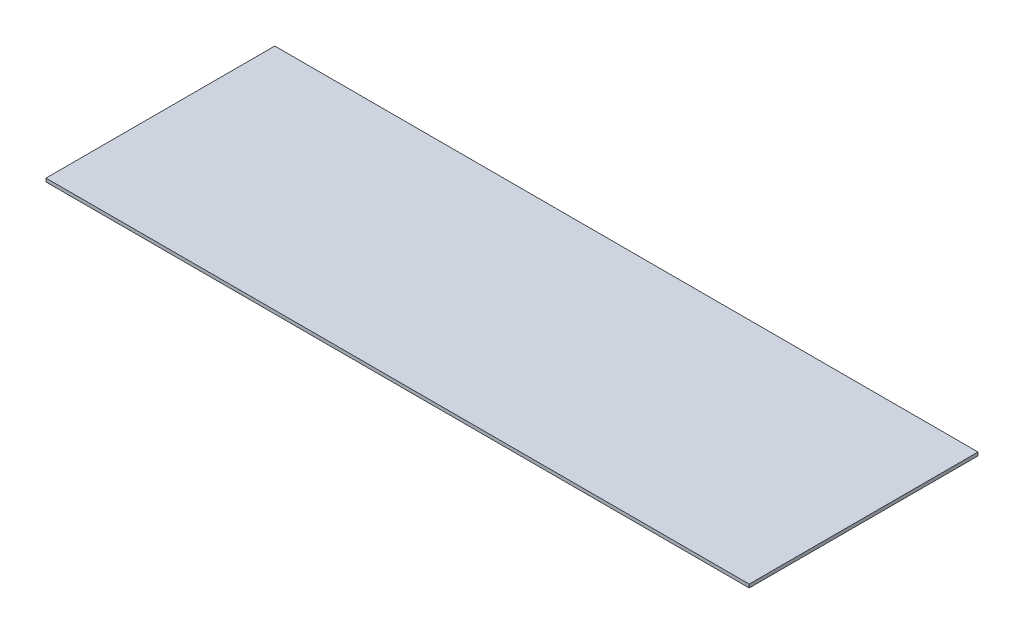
ISO-10303-21;
HEADER;
FILE_DESCRIPTION(('STEP AP214'),'2;1');
FILE_NAME('part.step','',(''),(''),'','','');
FILE_SCHEMA(('AUTOMOTIVE_DESIGN { 1 0 10303 214 1 1 1 1 }'));
ENDSEC;
DATA;
#1=APPLICATION_CONTEXT('core data for automotive mechanical design processes');
#2=APPLICATION_PROTOCOL_DEFINITION('international standard','automotive_design',2000,#1);
#3=PRODUCT_CONTEXT('',#1,'mechanical');
#4=PRODUCT('Part','Part','',(#3));
#5=PRODUCT_RELATED_PRODUCT_CATEGORY('part','',(#4));
#6=PRODUCT_DEFINITION_FORMATION('','',#4);
#7=PRODUCT_DEFINITION_CONTEXT('part definition',#1,'design');
#8=PRODUCT_DEFINITION('design','',#6,#7);
#9=PRODUCT_DEFINITION_SHAPE('','',#8);
#10=(LENGTH_UNIT() NAMED_UNIT(*) SI_UNIT(.MILLI.,.METRE.));
#11=(NAMED_UNIT(*) PLANE_ANGLE_UNIT() SI_UNIT($,.RADIAN.));
#12=(NAMED_UNIT(*) SI_UNIT($,.STERADIAN.) SOLID_ANGLE_UNIT());
#13=UNCERTAINTY_MEASURE_WITH_UNIT(LENGTH_MEASURE(1.E-05),#10,'distance_accuracy_value','');
#14=(GEOMETRIC_REPRESENTATION_CONTEXT(3) GLOBAL_UNCERTAINTY_ASSIGNED_CONTEXT((#13)) GLOBAL_UNIT_ASSIGNED_CONTEXT((#10,
#11,#12)) REPRESENTATION_CONTEXT('',''));
#15=CARTESIAN_POINT('',(0.,0.,0.));
#16=DIRECTION('',(0.,0.,1.));
#17=DIRECTION('',(1.,0.,0.));
#18=AXIS2_PLACEMENT_3D('',#15,#16,#17);
#19=CARTESIAN_POINT('',(-990.6,9.525,-322.2625));
#20=DIRECTION('',(1.,0.,0.));
#21=DIRECTION('',(0.,0.,-1.));
#22=AXIS2_PLACEMENT_3D('',#19,#20,#21);
#23=PLANE('',#22);
#24=DIRECTION('',(0.,0.,1.));
#25=VECTOR('',#24,1.);
#26=CARTESIAN_POINT('',(-990.6,0.,-322.2625));
#27=LINE('',#26,#25);
#28=CARTESIAN_POINT('',(-990.6,0.,-322.2625));
#29=VERTEX_POINT('',#28);
#30=CARTESIAN_POINT('',(-990.6,0.,322.2625));
#31=VERTEX_POINT('',#30);
#32=EDGE_CURVE('E404',#29,#31,#27,.T.);
#33=ORIENTED_EDGE('',*,*,#32,.T.);
#34=DIRECTION('',(0.,-1.,0.));
#35=VECTOR('',#34,1.);
#36=CARTESIAN_POINT('',(-990.6,9.525,322.2625));
#37=LINE('',#36,#35);
#38=CARTESIAN_POINT('',(-990.6,9.525,322.2625));
#39=VERTEX_POINT('',#38);
#40=EDGE_CURVE('E11',#39,#31,#37,.T.);
#41=ORIENTED_EDGE('',*,*,#40,.F.);
#42=DIRECTION('',(0.,0.,1.));
#43=VECTOR('',#42,1.);
#44=CARTESIAN_POINT('',(-990.6,9.525,-322.2625));
#45=LINE('',#44,#43);
#46=CARTESIAN_POINT('',(-990.6,9.525,-322.2625));
#47=VERTEX_POINT('',#46);
#48=EDGE_CURVE('E422',#47,#39,#45,.T.);
#49=ORIENTED_EDGE('',*,*,#48,.F.);
#50=DIRECTION('',(0.,-1.,0.));
#51=VECTOR('',#50,1.);
#52=CARTESIAN_POINT('',(-990.6,9.525,-322.2625));
#53=LINE('',#52,#51);
#54=EDGE_CURVE('E416',#47,#29,#53,.T.);
#55=ORIENTED_EDGE('',*,*,#54,.T.);
#56=EDGE_LOOP('',(#33,#41,#49,#55));
#57=FACE_BOUND('',#56,.T.);
#58=ADVANCED_FACE('F360',(#57),#23,.F.);
#59=CARTESIAN_POINT('',(-990.6,9.525,322.2625));
#60=DIRECTION('',(0.,0.,-1.));
#61=DIRECTION('',(-1.,0.,0.));
#62=AXIS2_PLACEMENT_3D('',#59,#60,#61);
#63=PLANE('',#62);
#64=DIRECTION('',(1.,0.,0.));
#65=VECTOR('',#64,1.);
#66=CARTESIAN_POINT('',(-990.6,0.,322.2625));
#67=LINE('',#66,#65);
#68=CARTESIAN_POINT('',(990.6,0.,322.2625));
#69=VERTEX_POINT('',#68);
#70=EDGE_CURVE('E400',#31,#69,#67,.T.);
#71=ORIENTED_EDGE('',*,*,#70,.T.);
#72=DIRECTION('',(0.,-1.,0.));
#73=VECTOR('',#72,1.);
#74=CARTESIAN_POINT('',(990.6,9.525,322.2625));
#75=LINE('',#74,#73);
#76=CARTESIAN_POINT('',(990.6,9.525,322.2625));
#77=VERTEX_POINT('',#76);
#78=EDGE_CURVE('E367',#77,#69,#75,.T.);
#79=ORIENTED_EDGE('',*,*,#78,.F.);
#80=DIRECTION('',(1.,0.,0.));
#81=VECTOR('',#80,1.);
#82=CARTESIAN_POINT('',(-990.6,9.525,322.2625));
#83=LINE('',#82,#81);
#84=EDGE_CURVE('E412',#39,#77,#83,.T.);
#85=ORIENTED_EDGE('',*,*,#84,.F.);
#86=ORIENTED_EDGE('',*,*,#40,.T.);
#87=EDGE_LOOP('',(#71,#79,#85,#86));
#88=FACE_BOUND('',#87,.T.);
#89=ADVANCED_FACE('F411',(#88),#63,.F.);
#90=CARTESIAN_POINT('',(990.6,9.525,-322.2625));
#91=DIRECTION('',(-1.,0.,0.));
#92=DIRECTION('',(0.,0.,1.));
#93=AXIS2_PLACEMENT_3D('',#90,#91,#92);
#94=PLANE('',#93);
#95=DIRECTION('',(0.,0.,-1.));
#96=VECTOR('',#95,1.);
#97=CARTESIAN_POINT('',(990.6,0.,-322.2625));
#98=LINE('',#97,#96);
#99=CARTESIAN_POINT('',(990.6,0.,-322.2625));
#100=VERTEX_POINT('',#99);
#101=EDGE_CURVE('E405',#69,#100,#98,.T.);
#102=ORIENTED_EDGE('',*,*,#101,.T.);
#103=DIRECTION('',(0.,-1.,0.));
#104=VECTOR('',#103,1.);
#105=CARTESIAN_POINT('',(990.6,9.525,-322.2625));
#106=LINE('',#105,#104);
#107=CARTESIAN_POINT('',(990.6,9.525,-322.2625));
#108=VERTEX_POINT('',#107);
#109=EDGE_CURVE('E428',#108,#100,#106,.T.);
#110=ORIENTED_EDGE('',*,*,#109,.F.);
#111=DIRECTION('',(0.,0.,-1.));
#112=VECTOR('',#111,1.);
#113=CARTESIAN_POINT('',(990.6,9.525,-322.2625));
#114=LINE('',#113,#112);
#115=EDGE_CURVE('E379',#77,#108,#114,.T.);
#116=ORIENTED_EDGE('',*,*,#115,.F.);
#117=ORIENTED_EDGE('',*,*,#78,.T.);
#118=EDGE_LOOP('',(#102,#110,#116,#117));
#119=FACE_BOUND('',#118,.T.);
#120=ADVANCED_FACE('F431',(#119),#94,.F.);
#121=CARTESIAN_POINT('',(-990.6,9.525,-322.2625));
#122=DIRECTION('',(0.,0.,1.));
#123=DIRECTION('',(1.,0.,0.));
#124=AXIS2_PLACEMENT_3D('',#121,#122,#123);
#125=PLANE('',#124);
#126=DIRECTION('',(-1.,0.,0.));
#127=VECTOR('',#126,1.);
#128=CARTESIAN_POINT('',(-990.6,0.,-322.2625));
#129=LINE('',#128,#127);
#130=EDGE_CURVE('E420',#100,#29,#129,.T.);
#131=ORIENTED_EDGE('',*,*,#130,.T.);
#132=ORIENTED_EDGE('',*,*,#54,.F.);
#133=DIRECTION('',(-1.,0.,0.));
#134=VECTOR('',#133,1.);
#135=CARTESIAN_POINT('',(-990.6,9.525,-322.2625));
#136=LINE('',#135,#134);
#137=EDGE_CURVE('E374',#108,#47,#136,.T.);
#138=ORIENTED_EDGE('',*,*,#137,.F.);
#139=ORIENTED_EDGE('',*,*,#109,.T.);
#140=EDGE_LOOP('',(#131,#132,#138,#139));
#141=FACE_BOUND('',#140,.T.);
#142=ADVANCED_FACE('F433',(#141),#125,.F.);
#143=CARTESIAN_POINT('',(-990.6,9.525,322.2625));
#144=DIRECTION('',(0.,1.,0.));
#145=DIRECTION('',(0.,0.,1.));
#146=AXIS2_PLACEMENT_3D('',#143,#144,#145);
#147=PLANE('',#146);
#148=ORIENTED_EDGE('',*,*,#48,.T.);
#149=ORIENTED_EDGE('',*,*,#84,.T.);
#150=ORIENTED_EDGE('',*,*,#115,.T.);
#151=ORIENTED_EDGE('',*,*,#137,.T.);
#152=EDGE_LOOP('',(#148,#149,#150,#151));
#153=FACE_BOUND('',#152,.T.);
#154=ADVANCED_FACE('F434',(#153),#147,.T.);
#155=CARTESIAN_POINT('',(-990.6,0.,322.2625));
#156=DIRECTION('',(0.,1.,0.));
#157=DIRECTION('',(0.,0.,1.));
#158=AXIS2_PLACEMENT_3D('',#155,#156,#157);
#159=PLANE('',#158);
#160=ORIENTED_EDGE('',*,*,#32,.F.);
#161=ORIENTED_EDGE('',*,*,#130,.F.);
#162=ORIENTED_EDGE('',*,*,#101,.F.);
#163=ORIENTED_EDGE('',*,*,#70,.F.);
#164=EDGE_LOOP('',(#160,#161,#162,#163));
#165=FACE_BOUND('',#164,.T.);
#166=ADVANCED_FACE('F401',(#165),#159,.F.);
#167=CLOSED_SHELL('',(#58,#89,#120,#142,#154,#166));
#168=MANIFOLD_SOLID_BREP('B2',#167);
#169=ADVANCED_BREP_SHAPE_REPRESENTATION('',(#18,#168),#14);
#170=SHAPE_DEFINITION_REPRESENTATION(#9,#169);
ENDSEC;
END-ISO-10303-21;
